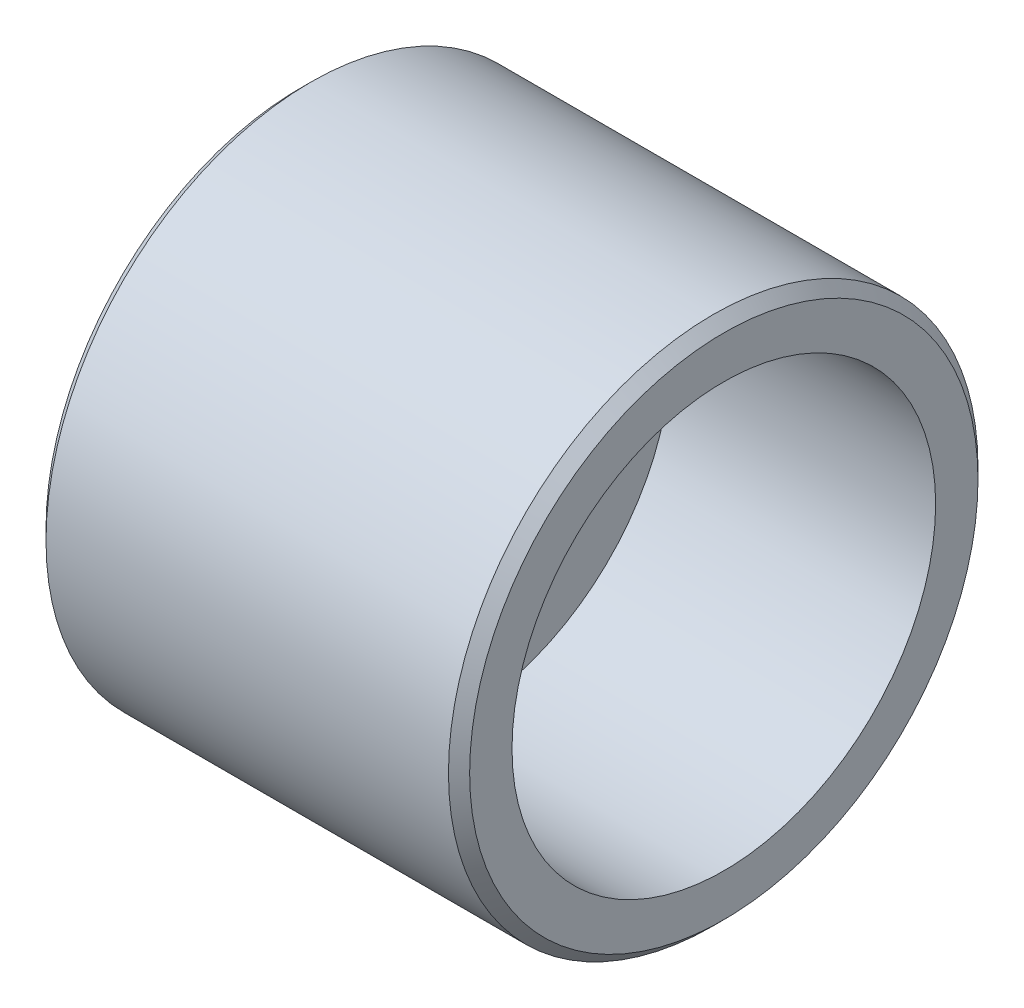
from build123d import *

# Parameters (mm, degrees)
CHANFREIN1_SIZE = 1


with BuildPart() as part:
    # Esquisse1 → R_volution1 (revolve)
    with BuildSketch(Plane.XY, mode=Mode.PRIVATE) as r_volution1_sk:
        Polygon((0, 25), (40, 25), (40, 20), (15, 20), (15, 12.5), (8, 12.5), (8, 16), (0, 16), align=None)
    revolve(r_volution1_sk.sketch.rotate(Axis((0, 0, 0), (1, 0, 0)), 90), axis=Axis((0, 0, 0), (1, 0, 0)))

    # Chanfrein1
    chanfrein1_edges = [part.edges().sort_by_distance(p)[0] for p in [
        (40, 0, -25),
        (0, 0, -25),
    ]]
    chamfer(chanfrein1_edges, length=CHANFREIN1_SIZE)


solid = part.part
